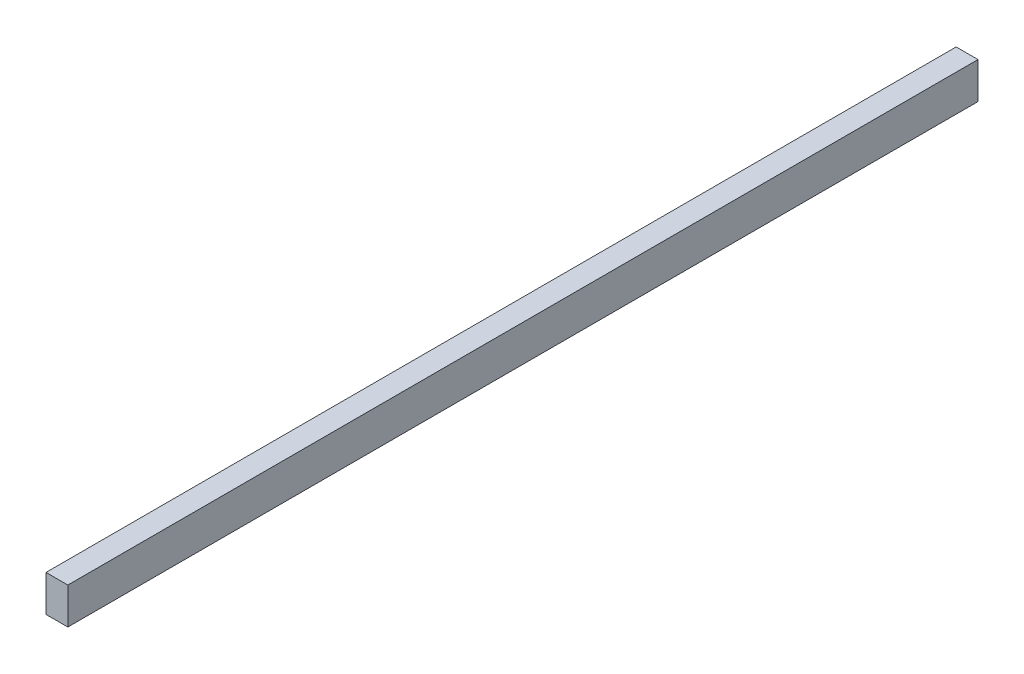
from build123d import *

# Parameters (mm, degrees)
ESQUISSE1_W      = 15
ESQUISSE1_H      = 25
EXTRUSION1_DEPTH = 625


with BuildPart() as part:
    # Esquisse1 → Extrusion1 (new body)
    with BuildSketch(Plane.XY):
        with Locations((7.5, 12.5)):
            Rectangle(ESQUISSE1_W, ESQUISSE1_H)
    extrude(amount=EXTRUSION1_DEPTH)


solid = part.part
